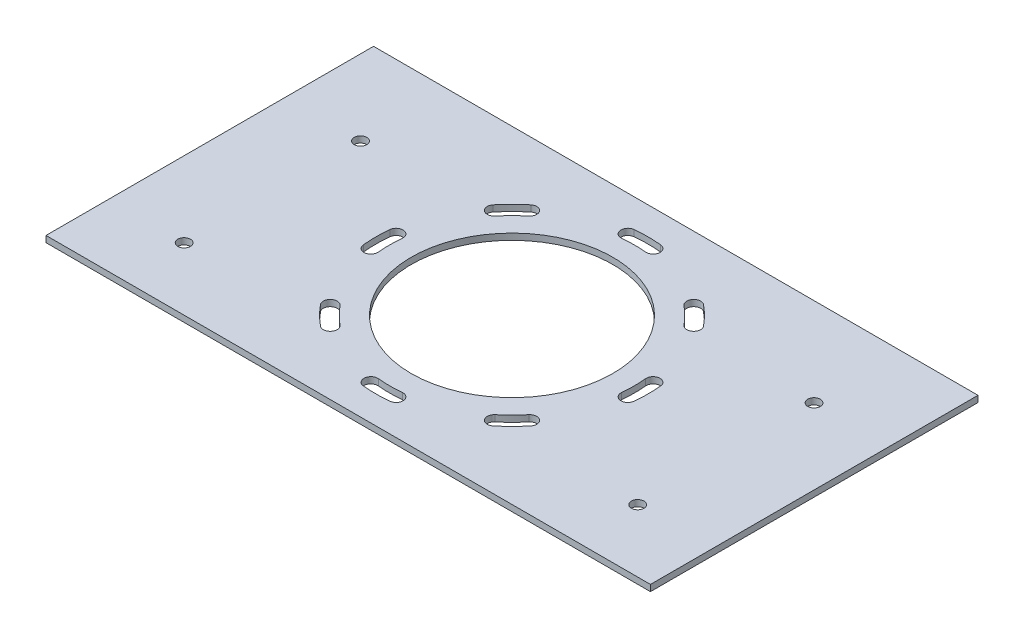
from build123d import *

# Parameters (mm, degrees)
SKETCH1_W           = 304.6625
SKETCH1_H           = 165.1
SKETCH1_R           = 3.175
BOSS_EXTRUDE1_DEPTH = 3.175
CUT_EXTRUDE1_DEPTH  = 3.175
SKETCH3_R           = 50.8
CUT_EXTRUDE2_DEPTH  = 3.175


with BuildPart() as part:
    # Sketch1 → Boss-Extrude1 (new body)
    with BuildSketch(Plane(origin=(0, 402.212122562, 0), x_dir=(1, 0, 0), z_dir=(0, 1, 0))):
        with Locations((-759.871620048, -1173.539151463)):
            Rectangle(SKETCH1_W, SKETCH1_H)
        with Locations(Location((-874.171620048, -1135.603252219, 0), (0, 0, 270))):
            Circle(SKETCH1_R, mode=Mode.SUBTRACT)
        with Locations(Location((-874.171620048, -1224.503252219, 0), (0, 0, 270))):
            Circle(SKETCH1_R, mode=Mode.SUBTRACT)
        with Locations(Location((-645.571620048, -1224.503252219, 0), (0, 0, 270))):
            Circle(SKETCH1_R, mode=Mode.SUBTRACT)
        with Locations(Location((-645.571620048, -1135.603252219, 0), (0, 0, 270))):
            Circle(SKETCH1_R, mode=Mode.SUBTRACT)
    extrude(amount=BOSS_EXTRUDE1_DEPTH)

    # Sketch2 → Cut-Extrude1 (cut)
    with BuildSketch(Plane(origin=(0, 405.387122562, 0), x_dir=(1, 0, 0), z_dir=(0, 1, 0))):
        with BuildLine():
            ThreePointArc((-753.18089565, -1105.284905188), (-759.871620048, -1104.957755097), (-766.562344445, -1105.284905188))
            ThreePointArc((-766.562344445, -1105.284905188), (-769.697459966, -1109.101469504), (-765.88089565, -1112.236585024))
            ThreePointArc((-765.88089565, -1112.236585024), (-759.871620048, -1111.942755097), (-753.862344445, -1112.236585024))
            ThreePointArc((-753.862344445, -1112.236585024), (-750.04578013, -1109.101469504), (-753.18089565, -1105.284905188))
        make_face()
        with BuildLine():
            ThreePointArc((-712.274960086, -1134.440890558), (-716.316390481, -1129.983921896), (-720.773359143, -1125.942491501))
            ThreePointArc((-720.773359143, -1125.942491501), (-721.255216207, -1121.026911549), (-716.339636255, -1120.545054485))
            ThreePointArc((-716.339636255, -1120.545054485), (-711.377249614, -1125.044781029), (-706.87752307, -1130.00716767))
            ThreePointArc((-706.87752307, -1130.00716767), (-707.359380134, -1134.922747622), (-712.274960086, -1134.440890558))
        make_face()
        with BuildLine():
            ThreePointArc((-698.569053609, -1179.548427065), (-698.275223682, -1173.539151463), (-698.569053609, -1167.52987586))
            ThreePointArc((-698.569053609, -1167.52987586), (-695.433938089, -1163.713311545), (-691.617373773, -1166.848427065))
            ThreePointArc((-691.617373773, -1166.848427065), (-691.290223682, -1173.539151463), (-691.617373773, -1180.22987586))
            ThreePointArc((-691.617373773, -1180.22987586), (-695.433938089, -1183.364991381), (-698.569053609, -1179.548427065))
        make_face()
        with BuildLine():
            ThreePointArc((-720.773359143, -1221.135811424), (-716.316390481, -1217.094381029), (-712.274960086, -1212.637412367))
            ThreePointArc((-712.274960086, -1212.637412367), (-707.359380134, -1212.155555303), (-706.87752307, -1217.071135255))
            ThreePointArc((-706.87752307, -1217.071135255), (-711.377249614, -1222.033521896), (-716.339636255, -1226.533248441))
            ThreePointArc((-716.339636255, -1226.533248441), (-721.255216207, -1226.051391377), (-720.773359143, -1221.135811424))
        make_face()
        with BuildLine():
            ThreePointArc((-765.88089565, -1234.841717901), (-759.871620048, -1235.135547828), (-753.862344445, -1234.841717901))
            ThreePointArc((-753.862344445, -1234.841717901), (-750.04578013, -1237.976833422), (-753.18089565, -1241.793397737))
            ThreePointArc((-753.18089565, -1241.793397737), (-759.871620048, -1242.120547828), (-766.562344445, -1241.793397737))
            ThreePointArc((-766.562344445, -1241.793397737), (-769.697459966, -1237.976833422), (-765.88089565, -1234.841717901))
        make_face()
        with BuildLine():
            ThreePointArc((-807.468280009, -1212.637412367), (-803.426849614, -1217.094381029), (-798.969880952, -1221.135811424))
            ThreePointArc((-798.969880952, -1221.135811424), (-798.488023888, -1226.051391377), (-803.40360384, -1226.533248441))
            ThreePointArc((-803.40360384, -1226.533248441), (-808.365990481, -1222.033521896), (-812.865717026, -1217.071135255))
            ThreePointArc((-812.865717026, -1217.071135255), (-812.383859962, -1212.155555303), (-807.468280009, -1212.637412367))
        make_face()
        with BuildLine():
            ThreePointArc((-821.174186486, -1167.52987586), (-821.468016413, -1173.539151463), (-821.174186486, -1179.548427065))
            ThreePointArc((-821.174186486, -1179.548427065), (-824.309302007, -1183.364991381), (-828.125866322, -1180.22987586))
            ThreePointArc((-828.125866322, -1180.22987586), (-828.453016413, -1173.539151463), (-828.125866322, -1166.848427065))
            ThreePointArc((-828.125866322, -1166.848427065), (-824.309302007, -1163.713311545), (-821.174186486, -1167.52987586))
        make_face()
        with BuildLine():
            ThreePointArc((-798.969880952, -1125.942491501), (-803.426849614, -1129.983921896), (-807.468280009, -1134.440890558))
            ThreePointArc((-807.468280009, -1134.440890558), (-812.383859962, -1134.922747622), (-812.865717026, -1130.00716767))
            ThreePointArc((-812.865717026, -1130.00716767), (-808.365990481, -1125.044781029), (-803.40360384, -1120.545054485))
            ThreePointArc((-803.40360384, -1120.545054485), (-798.488023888, -1121.026911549), (-798.969880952, -1125.942491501))
        make_face()
    extrude(amount=-CUT_EXTRUDE1_DEPTH, mode=Mode.SUBTRACT)

    # Sketch3 → Cut-Extrude2 (cut)
    with BuildSketch(Plane(origin=(0, 405.387122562, 0), x_dir=(1, 0, 0), z_dir=(0, 1, 0))):
        with Locations(Location((-759.871620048, -1173.539151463, 0), (0, 0, 270))):
            Circle(SKETCH3_R)
    extrude(amount=-CUT_EXTRUDE2_DEPTH, mode=Mode.SUBTRACT)


solid = part.part
